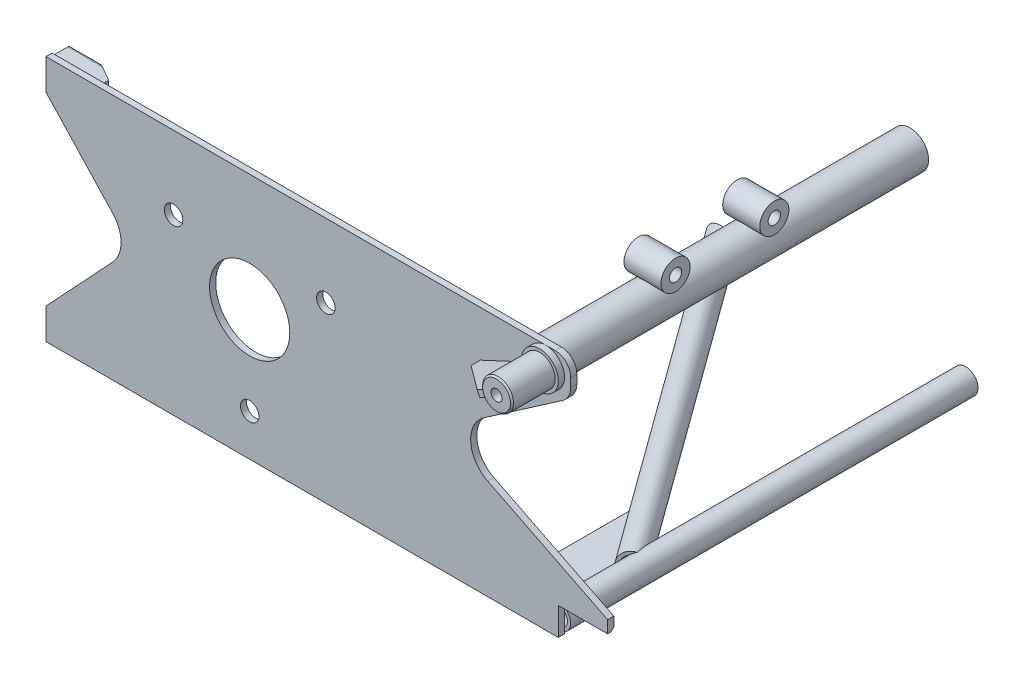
from build123d import *

# Parameters (mm, degrees)
SKETCH2_R                = 4.7625
SKETCH2_R_2              = 20.6375
SKETCH2_R_3              = 3.175
BOSS_EXTRUDE1_DEPTH      = 3.175
SKETCH7_R                = 6.35
SKETCH7_R_2              = 4.699
EXTRUDE_THIN1_DEPTH      = 209.55
SKETCH7_R_3              = 9.525
SKETCH7_R_4              = 7.874
EXTRUDE_THIN1_2_DEPTH    = 209.55
FILLET7_R                = 15.875
FILLET8_R                = 15.875
CHAMFER1_SIZE            = 1.524
EXTRUDE_THIN2_START      = 3.175
SKETCH12_R               = 7.9375
SKETCH12_R_2             = 2.8575
EXTRUDE_THIN2_DEPTH      = 25.4
CHAMFER2_SIZE            = 0.762
BOSS_EXTRUDE9_START      = 3.175
SKETCH23_R               = 9.525
SKETCH23_R_2             = 3.175
BOSS_EXTRUDE9_DEPTH      = 3.175
BOSS_EXTRUDE4_START      = -66.675
BOSS_EXTRUDE4_DEPTH      = 3.175
EXTRUDE_THIN4_DEPTH      = 207.94125
EXTRUDE_THIN4_DEPTH_BACK = 7.62
SKETCH11_R               = 6.35
SKETCH11_R_2             = 4.699
FILLET11_R               = 12.7
FILLET12_R               = 4.7752
SKETCH16_W               = 25.4
SKETCH16_H               = 10.16
BOSS_EXTRUDE5_DEPTH      = 9.525
BOSS_EXTRUDE5_2_DEPTH    = 9.525
SKETCH18_R               = 3.175
CUT_EXTRUDE1_DEPTH       = 15.875
CHAMFER5_SIZE            = 10.16
CHAMFER5_SIZE2           = 5.865878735
CHAMFER6_SIZE            = 10.16
CHAMFER6_SIZE2           = 5.865878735
FILLET13_R               = 1.5748
FILLET14_R               = 1.5748
SKETCH24_R               = 2.3876
CUT_EXTRUDE4_DEPTH       = 6.35
CUT_EXTRUDE5_DEPTH       = 295.270598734
CUT_EXTRUDE5_DEPTH_BACK  = 295.270598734
FILLET17_R               = 7.9248
SKETCH27_R               = 6.35
CUT_EXTRUDE6_DEPTH       = 86.36
FILLET18_R               = 9.525
BOSS_EXTRUDE10_DEPTH     = 1.5875
BOSS_EXTRUDE11_START     = 117.475
SKETCH29_R               = 7.493
SKETCH29_R_2             = 3.175
BOSS_EXTRUDE11_DEPTH     = 19.05
BOSS_EXTRUDE11_2_DEPTH   = 19.05
SKETCH30_R               = 9.525
CUT_EXTRUDE7_DEPTH       = 166.37


with BuildPart() as part:
    # Sketch2 → Boss-Extrude1 (new body)
    with BuildSketch(Plane.XY):
        Polygon((-104.775, -66.675), (158.75, -66.675), (158.75, -52.4002), (184.15, -52.4002), (184.15, -46.0502), (98.425, -3.175), (165.1, 42.8498), (165.1, 60.325), (-104.775, 60.325), (-104.775, 44.45), (-60.325, -3.175), (-104.775, -50.8), align=None)
        with Locations((0, -45.2374)):
            Circle(SKETCH2_R, mode=Mode.SUBTRACT)
        Circle(SKETCH2_R_2, mode=Mode.SUBTRACT)
        with Locations((39.176737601, 22.6187)):
            Circle(SKETCH2_R, mode=Mode.SUBTRACT)
        with Locations((-39.176737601, 22.6187)):
            Circle(SKETCH2_R, mode=Mode.SUBTRACT)
        with Locations((152.4, 50.8)):
            Circle(SKETCH2_R_3, mode=Mode.SUBTRACT)
    extrude(amount=BOSS_EXTRUDE1_DEPTH)

    # Fillet7
    fillet7_edges = [part.edges().sort_by_distance(p)[0] for p in [
        (-60.325, -3.175, 1.5875),
    ]]
    fillet(fillet7_edges, radius=FILLET7_R)

    # Fillet8
    fillet8_edges = [part.edges().sort_by_distance(p)[0] for p in [
        (98.425, -3.175, 1.5875),
    ]]
    fillet(fillet8_edges, radius=FILLET8_R)

    # Chamfer1
    chamfer1_edges = [part.edges().sort_by_distance(p)[0] for p in [
        (171.45, -52.4002, 0),
    ]]
    chamfer(chamfer1_edges, length=CHAMFER1_SIZE)

    # Sketch24 → Cut-Extrude4 (cut, symmetric)
    with BuildSketch(Plane.XY):
        with Locations((127, 28.575)):
            Circle(SKETCH24_R)
    extrude(amount=CUT_EXTRUDE4_DEPTH, both=True, mode=Mode.SUBTRACT)

    # Fillet17
    fillet17_edges = [part.edges().sort_by_distance(p)[0] for p in [
        (165.1, 60.325, 1.5875),
    ]]
    fillet(fillet17_edges, radius=FILLET17_R)

    # Fillet18
    fillet18_edges = [part.edges().sort_by_distance(p)[0] for p in [
        (165.1, 42.8498, 1.5875),
    ]]
    fillet(fillet18_edges, radius=FILLET18_R)


with BuildPart() as body_2:
    # Sketch7 → Extrude-Thin1 (new body)
    with BuildSketch(Plane.XY):
        with Locations((155.575, -60.325)):
            Circle(SKETCH7_R)
        with Locations((155.575, -60.325)):
            Circle(SKETCH7_R_2, mode=Mode.SUBTRACT)
    extrude(amount=-EXTRUDE_THIN1_DEPTH)


with BuildPart() as body_3:
    # Sketch7 → Extrude-Thin1 2 (new body)
    with BuildSketch(Plane.XY):
        with Locations((127, 28.575)):
            Circle(SKETCH7_R_3)
        with Locations((127, 28.575)):
            Circle(SKETCH7_R_4, mode=Mode.SUBTRACT)
    extrude(amount=-EXTRUDE_THIN1_2_DEPTH)


with BuildPart() as body_4:
    # Sketch12 → Extrude-Thin2 (new body)
    with BuildSketch(Plane.XY.offset(EXTRUDE_THIN2_START)):
        with Locations((152.4, 50.8)):
            Circle(SKETCH12_R)
        with Locations((152.4, 50.8)):
            Circle(SKETCH12_R_2, mode=Mode.SUBTRACT)
    extrude(amount=EXTRUDE_THIN2_DEPTH)

    # Chamfer2
    chamfer2_edges = [body_4.edges().sort_by_distance(p)[0] for p in [
        (144.4625, 50.8, 28.575),
    ]]
    chamfer(chamfer2_edges, length=CHAMFER2_SIZE)

    # Sketch23 → Boss-Extrude9 (add)
    with BuildSketch(Plane.XY.offset(BOSS_EXTRUDE9_START)):
        with Locations((152.4, 50.8)):
            Circle(SKETCH23_R)
        with Locations((152.4, 50.8)):
            Circle(SKETCH23_R_2, mode=Mode.SUBTRACT)
    extrude(amount=BOSS_EXTRUDE9_DEPTH)


with BuildPart() as body_5:
    # Sketch14 → Boss-Extrude4 (new body)
    with BuildSketch(Plane(origin=(0, 0, 0), x_dir=(1, 0, 0), z_dir=(0, 1, 0)).offset(BOSS_EXTRUDE4_START)):
        Polygon((98.425, 0), (98.425, 6.35), (123.825, 15.59484395), (123.825, 74.6252), (149.225, 39.66509922), (149.225, 0), align=None)
    extrude(amount=BOSS_EXTRUDE4_DEPTH)

    # Fillet11
    fillet11_edges = [body_5.edges().sort_by_distance(p)[0] for p in [
        (123.825, -65.0875, -15.59484395),
    ]]
    fillet(fillet11_edges, radius=FILLET11_R)

    # Fillet12
    fillet12_edges = [body_5.edges().sort_by_distance(p)[0] for p in [
        (98.425, -65.0875, -6.35),
    ]]
    fillet(fillet12_edges, radius=FILLET12_R)


with BuildPart() as body_6:
    # Sketch11 → Extrude-Thin4 (new, two sides: drawn at the far end of the back side and taken through both)
    with BuildSketch(Plane(origin=(147.6248, -60.325, -47.671995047), x_dir=(-0.8090169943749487, 0, 0.5877852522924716), z_dir=(-0.5877852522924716, 0, -0.8090169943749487)).offset(-EXTRUDE_THIN4_DEPTH_BACK)):
        Circle(SKETCH11_R)
        Circle(SKETCH11_R_2, mode=Mode.SUBTRACT)
    extrude(amount=EXTRUDE_THIN4_DEPTH + EXTRUDE_THIN4_DEPTH_BACK)

    # Sketch25 → Cut-Extrude5 (cut, two sides: drawn at the far end of the back side and taken through both)
    with BuildSketch(Plane(origin=(0, 0, 0), x_dir=(1, 0, 0), z_dir=(0, 1, 0)).offset(-CUT_EXTRUDE5_DEPTH_BACK)):
        Polygon((-817.690143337, 209.55), (-86.581897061, 209.55), (95.163235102, 209.55), (826.271481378, 209.55), (826.271481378, 1671.76649255), (-817.690143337, 1671.76649255), align=None)
    extrude(amount=CUT_EXTRUDE5_DEPTH + CUT_EXTRUDE5_DEPTH_BACK, mode=Mode.SUBTRACT)

    # Sketch27 → Cut-Extrude6 (cut)
    with BuildSketch(Plane.XY):
        with Locations((155.575, -60.325)):
            Circle(SKETCH27_R)
    extrude(amount=-CUT_EXTRUDE6_DEPTH, mode=Mode.SUBTRACT)


with BuildPart() as body_7:
    # Sketch16 → Boss-Extrude5 (new body)
    with BuildSketch(Plane.XY):
        with Locations((-92.075, 53.975)):
            Rectangle(SKETCH16_W, SKETCH16_H)
    extrude(amount=-BOSS_EXTRUDE5_DEPTH)


with BuildPart() as body_8:
    # Sketch16 → Boss-Extrude5 2 (new body)
    with BuildSketch(Plane.XY):
        with Locations((-92.075, -60.325)):
            Rectangle(SKETCH16_W, SKETCH16_H)
    extrude(amount=-BOSS_EXTRUDE5_2_DEPTH)


with BuildPart() as cut_extrude1_tool:
    # Sketch18 → Cut-Extrude1 (new body)
    with BuildSketch(Plane.ZY.offset(104.775)):
        with Locations((-4.7625, 53.975)):
            Circle(SKETCH18_R)
        with Locations((-4.7625, -60.325)):
            Circle(SKETCH18_R)
    extrude(amount=-CUT_EXTRUDE1_DEPTH)


with BuildPart() as body_7_1:
    add(body_7.part)

    # Cut-Extrude1: cut by cut_extrude1_tool
    add(cut_extrude1_tool.part, mode=Mode.SUBTRACT)

    # Chamfer5
    chamfer5_edges = [body_7_1.edges().sort_by_distance(p)[0] for p in [
        (-79.375, 53.975, -9.525),
    ]]
    chamfer5_side = [body_7_1.faces().sort_by_distance(p)[0] for p in [
        (-92.075, 53.975, -9.525),
    ]]
    chamfer(chamfer5_edges, length=CHAMFER5_SIZE, length2=CHAMFER5_SIZE2, reference=chamfer5_side[0])

    # Fillet13
    fillet13_edges = [body_7_1.edges().sort_by_distance(p)[0] for p in [
        (-97.155, 59.055, -9.525),
        (-97.155, 48.895, -9.525),
    ]]
    fillet(fillet13_edges, radius=FILLET13_R)


with BuildPart() as body_8_1:
    add(body_8.part)

    # Cut-Extrude1: cut by cut_extrude1_tool
    add(cut_extrude1_tool.part, mode=Mode.SUBTRACT)

    # Chamfer6
    chamfer6_edges = [body_8_1.edges().sort_by_distance(p)[0] for p in [
        (-79.375, -60.325, -9.525),
    ]]
    chamfer6_side = [body_8_1.faces().sort_by_distance(p)[0] for p in [
        (-92.075, -60.325, -9.525),
    ]]
    chamfer(chamfer6_edges, length=CHAMFER6_SIZE, length2=CHAMFER6_SIZE2, reference=chamfer6_side[0])

    # Fillet14
    fillet14_edges = [body_8_1.edges().sort_by_distance(p)[0] for p in [
        (-97.155, -65.405, -9.525),
        (-97.155, -55.245, -9.525),
    ]]
    fillet(fillet14_edges, radius=FILLET14_R)


with BuildPart() as body_9:
    # Sketch28 → Boss-Extrude10 (new, symmetric)
    with BuildSketch(Plane(origin=(7.762055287, -16.64578128, 0), x_dir=(0.9063077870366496, 0.4226182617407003, 0), z_dir=(-0.4226182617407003, 0.9063077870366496, 0))):
        Polygon((151.652814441, -27.813), (148.477814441, -27.813), (123.077814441, -7.9502), (123.077814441, -3.175), (147.16268638, -3.175), (151.652814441, -7.665128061), align=None)
    extrude(amount=BOSS_EXTRUDE10_DEPTH, both=True)


with BuildPart() as body_10:
    # Sketch29 → Boss-Extrude11 (new body)
    with BuildSketch(Plane(origin=(0, 0, 0), x_dir=(0, 0, -1), z_dir=(1, 0, 0)).offset(BOSS_EXTRUDE11_START)):
        with Locations(Location((79.375, 42.418, 0), (0, 0, 180))):
            Circle(SKETCH29_R)
        with Locations(Location((79.375, 42.418, 0), (0, 0, 180))):
            Circle(SKETCH29_R_2, mode=Mode.SUBTRACT)
    extrude(amount=BOSS_EXTRUDE11_DEPTH)


with BuildPart() as body_11:
    # Sketch29 → Boss-Extrude11 2 (new body)
    with BuildSketch(Plane(origin=(0, 0, 0), x_dir=(0, 0, -1), z_dir=(1, 0, 0)).offset(BOSS_EXTRUDE11_START)):
        with Locations(Location((130.175, 42.418, 0), (0, 0, 180))):
            Circle(SKETCH29_R)
        with Locations(Location((130.175, 42.418, 0), (0, 0, 180))):
            Circle(SKETCH29_R_2, mode=Mode.SUBTRACT)
    extrude(amount=BOSS_EXTRUDE11_2_DEPTH)


with BuildPart() as cut_extrude7_tool:
    # Sketch30 → Cut-Extrude7 (new body)
    with BuildSketch(Plane.XY):
        with Locations((127, 28.575)):
            Circle(SKETCH30_R)
    extrude(amount=-CUT_EXTRUDE7_DEPTH)


with BuildPart() as body_10_1:
    add(body_10.part)

    # Cut-Extrude7: cut by cut_extrude7_tool
    add(cut_extrude7_tool.part, mode=Mode.SUBTRACT)


with BuildPart() as body_11_1:
    add(body_11.part)

    # Cut-Extrude7: cut by cut_extrude7_tool
    add(cut_extrude7_tool.part, mode=Mode.SUBTRACT)


solid = Compound([part.part, body_2.part, body_3.part, body_4.part, body_5.part, body_6.part, body_7_1.part, body_8_1.part, body_9.part, body_10_1.part, body_11_1.part])
